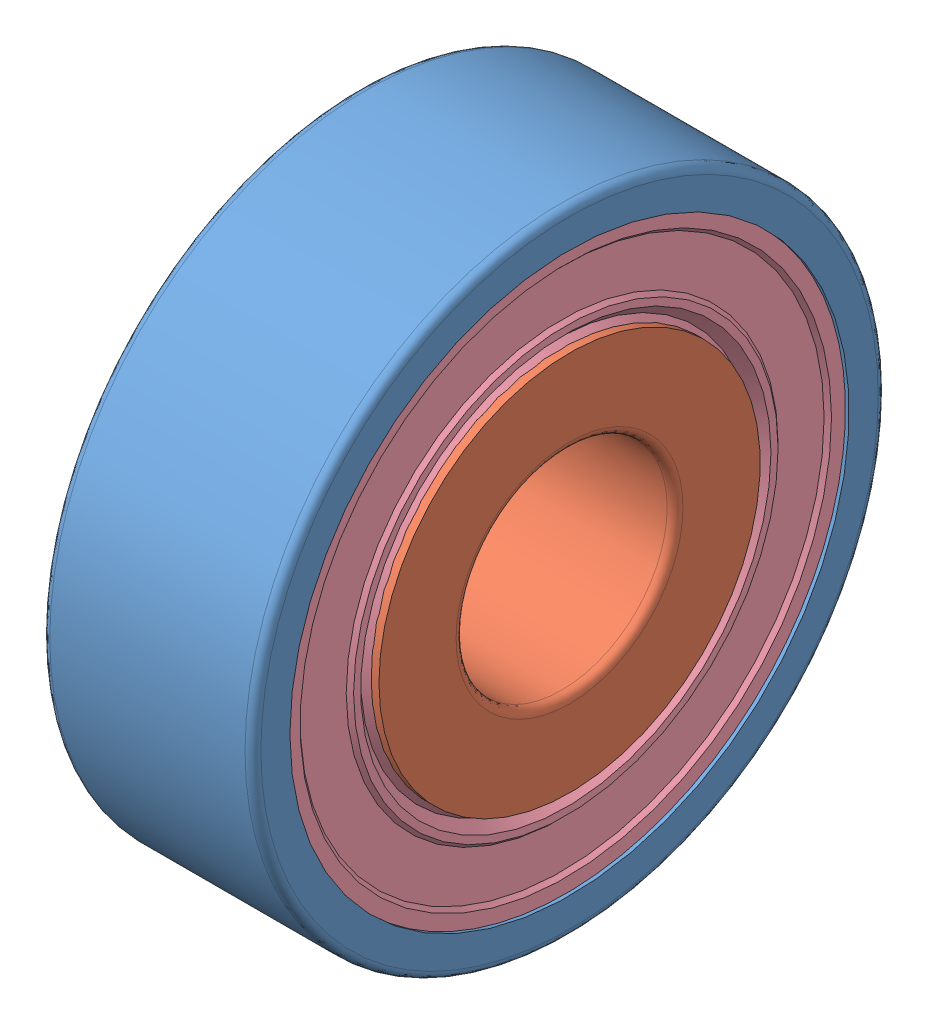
SolidWorks assembly roulement_628-2rs1_1.SLDASM, configuration Default (file format 11000). Lengths in mm.
Overall size (8 24 24).
5 component instances, 5 part files, 0 mates.
Components (placement in the parent):
- roulement_628-2rs1_1_01-1: roulement_628-2rs1_1_01.SLDPRT [Default] at origin size (8 24 24)
- roulement_628-2rs1_1_02-1: roulement_628-2rs1_1_02.SLDPRT [Default] at origin size (8 14.45 14.45)
- roulement_628-2rs1_1_03-1: roulement_628-2rs1_1_03.SLDPRT [Default] at origin size (0.77 21.78 21.78)
- roulement_628-2rs1_1_04-1: roulement_628-2rs1_1_04.SLDPRT [Default] at origin size (0.77 21.78 21.78)
- roulement_628-2rs1_1_05-1: roulement_628-2rs1_1_05.SLDPRT [Default] at origin size (3.97 20.97 20.97)
